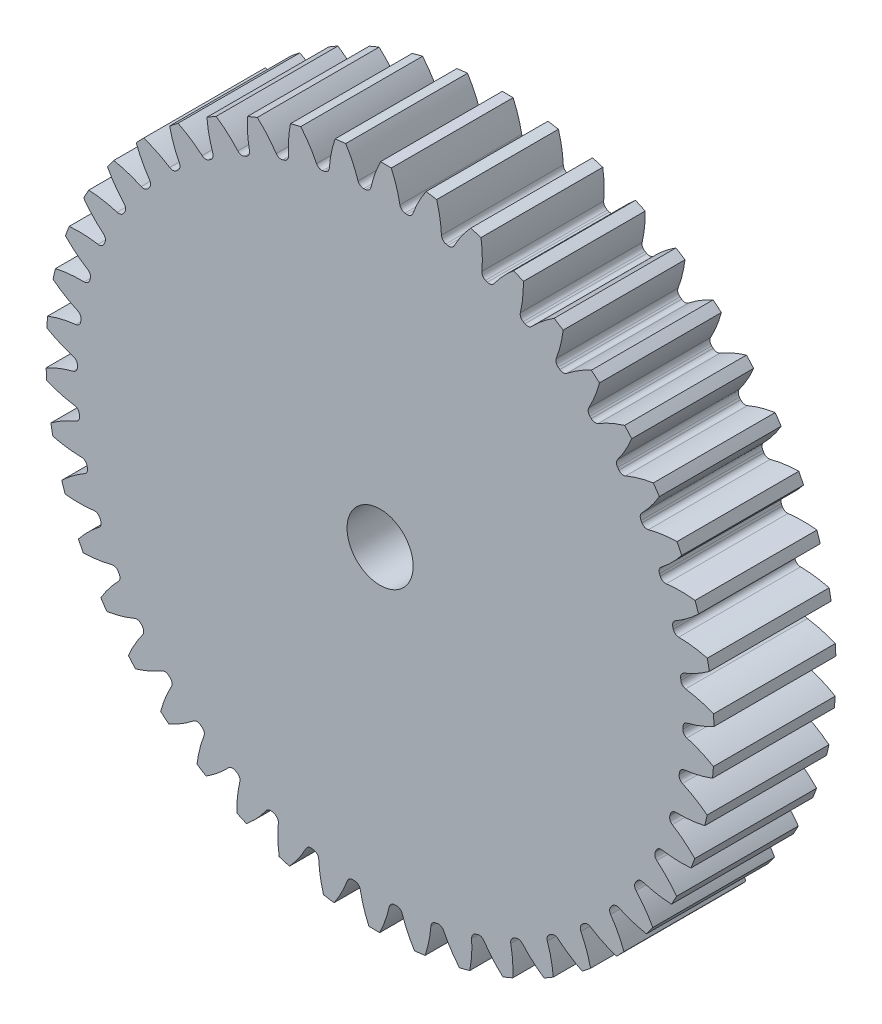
from build123d import *

# Parameters (mm, degrees)
SKETCH3_R         = 243.84
GEARBODY_DEPTH    = 88.9
TOOTHCUT_DEPTH    = 357.116696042
CIRPATTERN1_COUNT = 46
BOREDIA_R         = 24.13
BORE_DEPTH        = 12700


with BuildPart() as part:
    # Sketch3 → gearBody (new body)
    with BuildSketch(Plane.XY):
        Circle(SKETCH3_R)
    extrude(amount=GEARBODY_DEPTH)

    # Sketch2 → toothCut (cut, through all)
    with BuildSketch(Plane.XY):
        with BuildLine():
            ThreePointArc((220.932309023, -4.590776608), (220.946310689, -3.85852212), (220.957885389, -3.126225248))
            ThreePointArc((220.957885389, -3.126225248), (221.845601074, -0.624203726), (224.071698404, 0.8223928))
            ThreePointArc((224.071698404, 0.8223928), (234.196145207, 4.081562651), (243.84, 8.567393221))
            ThreePointArc((243.84, 8.567393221), (243.953265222, -4.260306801), (243.392169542, -17.076230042))
            ThreePointArc((243.392169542, -17.076230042), (233.910825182, -12.256404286), (223.906351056, -8.645710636))
            ThreePointArc((223.906351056, -8.645710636), (221.732121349, -7.122268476), (220.932309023, -4.590776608))
        make_face()
    toothcut = extrude(amount=TOOTHCUT_DEPTH, mode=Mode.SUBTRACT)

    # CirPattern1: toothCut ×46 about axis
    cirpattern1_axis = Axis((0, 0, 0), (0, 0, 1))
    for i in range(1, CIRPATTERN1_COUNT):
        add(toothcut.rotate(cirpattern1_axis, i * 360 / CIRPATTERN1_COUNT), mode=Mode.SUBTRACT)

    # boreDia → bore (cut, symmetric)
    with BuildSketch(Plane.XY):
        Circle(BOREDIA_R)
    extrude(amount=BORE_DEPTH, both=True, mode=Mode.SUBTRACT)


solid = part.part
